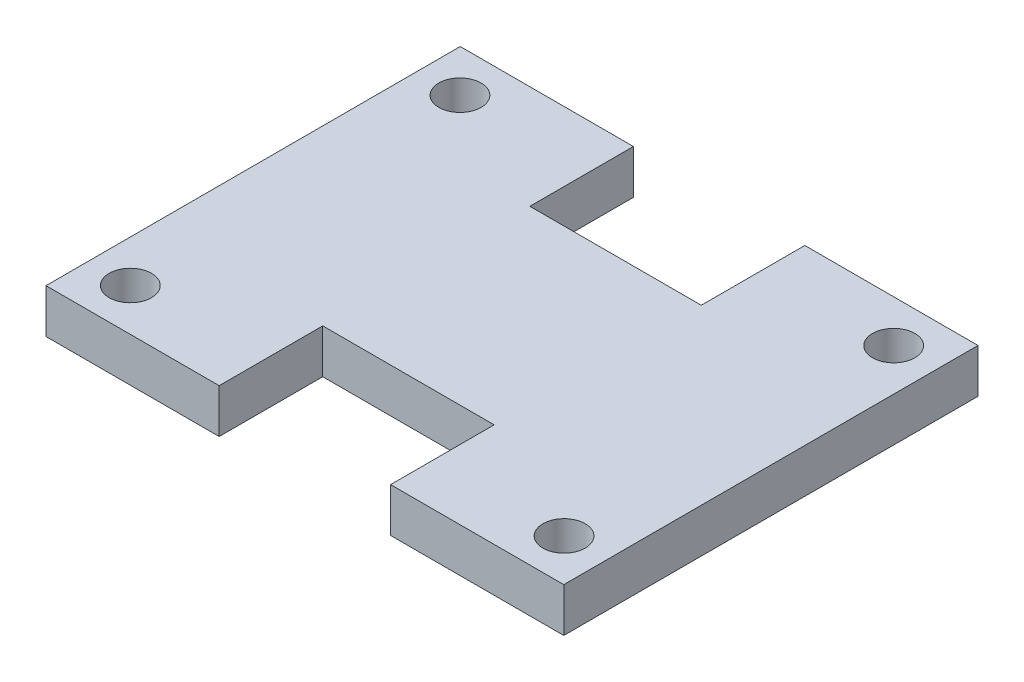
from build123d import *

# Parameters (mm, degrees)
BOSS_EXTRUDE1_DEPTH   = 2.54
F_2_CLEARANCE_HOLE1_D = 2.4384


with BuildPart() as part:
    # Sketch1 → Boss-Extrude1 (new body)
    with BuildSketch(Plane(origin=(0, 0, 0), x_dir=(1, 0, 0), z_dir=(0, 1, 0))):
        Polygon((-14.9225, 11.938), (-4.9403, 11.938), (-4.9403, 5.969), (4.9403, 5.969), (4.9403, 11.938), (14.9225, 11.938), (14.9225, -11.938), (4.9403, -11.938), (4.9403, -5.969), (-4.9403, -5.969), (-4.9403, -11.938), (-14.9225, -11.938), align=None)
    extrude(amount=BOSS_EXTRUDE1_DEPTH)

    # 2 Clearance Hole1 (through all)
    with Locations(Plane(origin=(0, 2.54, 0), x_dir=(1, 0, 0), z_dir=(0, 1, 0))):
        with Locations((-12.5, 9.4996), (12.5, 9.4996), (12.5, -9.4996), (-12.5, -9.4996)):
            Hole(F_2_CLEARANCE_HOLE1_D / 2)


solid = part.part
